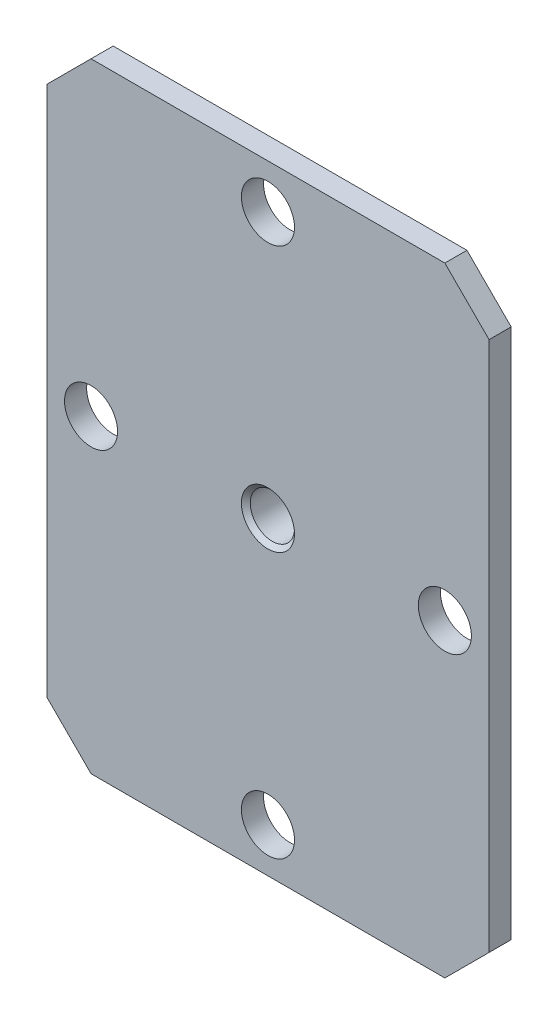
ISO-10303-21;
HEADER;
FILE_DESCRIPTION(('STEP AP214'),'2;1');
FILE_NAME('part.step','',(''),(''),'','','');
FILE_SCHEMA(('AUTOMOTIVE_DESIGN { 1 0 10303 214 1 1 1 1 }'));
ENDSEC;
DATA;
#1=APPLICATION_CONTEXT('core data for automotive mechanical design processes');
#2=APPLICATION_PROTOCOL_DEFINITION('international standard','automotive_design',2000,#1);
#3=PRODUCT_CONTEXT('',#1,'mechanical');
#4=PRODUCT('Part','Part','',(#3));
#5=PRODUCT_RELATED_PRODUCT_CATEGORY('part','',(#4));
#6=PRODUCT_DEFINITION_FORMATION('','',#4);
#7=PRODUCT_DEFINITION_CONTEXT('part definition',#1,'design');
#8=PRODUCT_DEFINITION('design','',#6,#7);
#9=PRODUCT_DEFINITION_SHAPE('','',#8);
#10=(LENGTH_UNIT() NAMED_UNIT(*) SI_UNIT(.MILLI.,.METRE.));
#11=(NAMED_UNIT(*) PLANE_ANGLE_UNIT() SI_UNIT($,.RADIAN.));
#12=(NAMED_UNIT(*) SI_UNIT($,.STERADIAN.) SOLID_ANGLE_UNIT());
#13=UNCERTAINTY_MEASURE_WITH_UNIT(LENGTH_MEASURE(1.E-05),#10,'distance_accuracy_value','');
#14=(GEOMETRIC_REPRESENTATION_CONTEXT(3) GLOBAL_UNCERTAINTY_ASSIGNED_CONTEXT((#13)) GLOBAL_UNIT_ASSIGNED_CONTEXT((#10,
#11,#12)) REPRESENTATION_CONTEXT('',''));
#15=CARTESIAN_POINT('',(0.,0.,0.));
#16=DIRECTION('',(0.,0.,1.));
#17=DIRECTION('',(1.,0.,0.));
#18=AXIS2_PLACEMENT_3D('',#15,#16,#17);
#19=CARTESIAN_POINT('',(-50.,70.,5.));
#20=DIRECTION('',(0.,-1.,0.));
#21=DIRECTION('',(1.,0.,0.));
#22=AXIS2_PLACEMENT_3D('',#19,#20,#21);
#23=PLANE('',#22);
#24=DIRECTION('',(-1.,0.,0.));
#25=VECTOR('',#24,1.);
#26=CARTESIAN_POINT('',(-50.,70.,0.));
#27=LINE('',#26,#25);
#28=CARTESIAN_POINT('',(40.,70.,0.));
#29=VERTEX_POINT('',#28);
#30=CARTESIAN_POINT('',(-40.,70.,0.));
#31=VERTEX_POINT('',#30);
#32=EDGE_CURVE('E190',#29,#31,#27,.T.);
#33=ORIENTED_EDGE('',*,*,#32,.T.);
#34=DIRECTION('',(0.,0.,1.));
#35=VECTOR('',#34,1.);
#36=CARTESIAN_POINT('',(-40.,70.,5.));
#37=LINE('',#36,#35);
#38=CARTESIAN_POINT('',(-40.,70.,5.));
#39=VERTEX_POINT('',#38);
#40=EDGE_CURVE('E228',#31,#39,#37,.T.);
#41=ORIENTED_EDGE('',*,*,#40,.T.);
#42=DIRECTION('',(-1.,0.,0.));
#43=VECTOR('',#42,1.);
#44=CARTESIAN_POINT('',(-50.,70.,5.));
#45=LINE('',#44,#43);
#46=CARTESIAN_POINT('',(40.,70.,5.));
#47=VERTEX_POINT('',#46);
#48=EDGE_CURVE('E191',#47,#39,#45,.T.);
#49=ORIENTED_EDGE('',*,*,#48,.F.);
#50=DIRECTION('',(0.,0.,-1.));
#51=VECTOR('',#50,1.);
#52=CARTESIAN_POINT('',(40.,70.,5.));
#53=LINE('',#52,#51);
#54=EDGE_CURVE('E225',#47,#29,#53,.T.);
#55=ORIENTED_EDGE('',*,*,#54,.T.);
#56=EDGE_LOOP('',(#33,#41,#49,#55));
#57=FACE_BOUND('',#56,.T.);
#58=ADVANCED_FACE('F33',(#57),#23,.F.);
#59=CARTESIAN_POINT('',(-50.,-70.,5.));
#60=DIRECTION('',(1.,0.,0.));
#61=DIRECTION('',(0.,1.,0.));
#62=AXIS2_PLACEMENT_3D('',#59,#60,#61);
#63=PLANE('',#62);
#64=DIRECTION('',(0.,-1.,0.));
#65=VECTOR('',#64,1.);
#66=CARTESIAN_POINT('',(-50.,-70.,5.));
#67=LINE('',#66,#65);
#68=CARTESIAN_POINT('',(-50.,60.,5.));
#69=VERTEX_POINT('',#68);
#70=CARTESIAN_POINT('',(-50.,-60.,5.));
#71=VERTEX_POINT('',#70);
#72=EDGE_CURVE('E194',#69,#71,#67,.T.);
#73=ORIENTED_EDGE('',*,*,#72,.F.);
#74=DIRECTION('',(0.,0.,-1.));
#75=VECTOR('',#74,1.);
#76=CARTESIAN_POINT('',(-50.,60.,5.));
#77=LINE('',#76,#75);
#78=CARTESIAN_POINT('',(-50.,60.,0.));
#79=VERTEX_POINT('',#78);
#80=EDGE_CURVE('E214',#69,#79,#77,.T.);
#81=ORIENTED_EDGE('',*,*,#80,.T.);
#82=DIRECTION('',(0.,-1.,0.));
#83=VECTOR('',#82,1.);
#84=CARTESIAN_POINT('',(-50.,-70.,0.));
#85=LINE('',#84,#83);
#86=CARTESIAN_POINT('',(-50.,-60.,0.));
#87=VERTEX_POINT('',#86);
#88=EDGE_CURVE('E206',#79,#87,#85,.T.);
#89=ORIENTED_EDGE('',*,*,#88,.T.);
#90=DIRECTION('',(0.,0.,1.));
#91=VECTOR('',#90,1.);
#92=CARTESIAN_POINT('',(-50.,-60.,5.));
#93=LINE('',#92,#91);
#94=EDGE_CURVE('E203',#87,#71,#93,.T.);
#95=ORIENTED_EDGE('',*,*,#94,.T.);
#96=EDGE_LOOP('',(#73,#81,#89,#95));
#97=FACE_BOUND('',#96,.T.);
#98=ADVANCED_FACE('F260',(#97),#63,.F.);
#99=CARTESIAN_POINT('',(-50.,-70.,5.));
#100=DIRECTION('',(0.,1.,0.));
#101=DIRECTION('',(-1.,0.,0.));
#102=AXIS2_PLACEMENT_3D('',#99,#100,#101);
#103=PLANE('',#102);
#104=DIRECTION('',(1.,0.,0.));
#105=VECTOR('',#104,1.);
#106=CARTESIAN_POINT('',(-50.,-70.,0.));
#107=LINE('',#106,#105);
#108=CARTESIAN_POINT('',(-40.,-70.,0.));
#109=VERTEX_POINT('',#108);
#110=CARTESIAN_POINT('',(40.,-70.,0.));
#111=VERTEX_POINT('',#110);
#112=EDGE_CURVE('E209',#109,#111,#107,.T.);
#113=ORIENTED_EDGE('',*,*,#112,.T.);
#114=DIRECTION('',(0.,0.,1.));
#115=VECTOR('',#114,1.);
#116=CARTESIAN_POINT('',(40.,-70.,5.));
#117=LINE('',#116,#115);
#118=CARTESIAN_POINT('',(40.,-70.,5.));
#119=VERTEX_POINT('',#118);
#120=EDGE_CURVE('E245',#111,#119,#117,.T.);
#121=ORIENTED_EDGE('',*,*,#120,.T.);
#122=DIRECTION('',(1.,0.,0.));
#123=VECTOR('',#122,1.);
#124=CARTESIAN_POINT('',(-50.,-70.,5.));
#125=LINE('',#124,#123);
#126=CARTESIAN_POINT('',(-40.,-70.,5.));
#127=VERTEX_POINT('',#126);
#128=EDGE_CURVE('E198',#127,#119,#125,.T.);
#129=ORIENTED_EDGE('',*,*,#128,.F.);
#130=DIRECTION('',(0.,0.,-1.));
#131=VECTOR('',#130,1.);
#132=CARTESIAN_POINT('',(-40.,-70.,5.));
#133=LINE('',#132,#131);
#134=EDGE_CURVE('E242',#127,#109,#133,.T.);
#135=ORIENTED_EDGE('',*,*,#134,.T.);
#136=EDGE_LOOP('',(#113,#121,#129,#135));
#137=FACE_BOUND('',#136,.T.);
#138=ADVANCED_FACE('F266',(#137),#103,.F.);
#139=CARTESIAN_POINT('',(50.,-70.,5.));
#140=DIRECTION('',(-1.,0.,0.));
#141=DIRECTION('',(0.,-1.,0.));
#142=AXIS2_PLACEMENT_3D('',#139,#140,#141);
#143=PLANE('',#142);
#144=DIRECTION('',(0.,1.,0.));
#145=VECTOR('',#144,1.);
#146=CARTESIAN_POINT('',(50.,-70.,0.));
#147=LINE('',#146,#145);
#148=CARTESIAN_POINT('',(50.,-60.,0.));
#149=VERTEX_POINT('',#148);
#150=CARTESIAN_POINT('',(50.,60.,0.));
#151=VERTEX_POINT('',#150);
#152=EDGE_CURVE('E195',#149,#151,#147,.T.);
#153=ORIENTED_EDGE('',*,*,#152,.T.);
#154=DIRECTION('',(0.,0.,1.));
#155=VECTOR('',#154,1.);
#156=CARTESIAN_POINT('',(50.,60.,5.));
#157=LINE('',#156,#155);
#158=CARTESIAN_POINT('',(50.,60.,5.));
#159=VERTEX_POINT('',#158);
#160=EDGE_CURVE('E56',#151,#159,#157,.T.);
#161=ORIENTED_EDGE('',*,*,#160,.T.);
#162=DIRECTION('',(0.,1.,0.));
#163=VECTOR('',#162,1.);
#164=CARTESIAN_POINT('',(50.,-70.,5.));
#165=LINE('',#164,#163);
#166=CARTESIAN_POINT('',(50.,-60.,5.));
#167=VERTEX_POINT('',#166);
#168=EDGE_CURVE('E201',#167,#159,#165,.T.);
#169=ORIENTED_EDGE('',*,*,#168,.F.);
#170=DIRECTION('',(0.,0.,-1.));
#171=VECTOR('',#170,1.);
#172=CARTESIAN_POINT('',(50.,-60.,5.));
#173=LINE('',#172,#171);
#174=EDGE_CURVE('E238',#167,#149,#173,.T.);
#175=ORIENTED_EDGE('',*,*,#174,.T.);
#176=EDGE_LOOP('',(#153,#161,#169,#175));
#177=FACE_BOUND('',#176,.T.);
#178=ADVANCED_FACE('F304',(#177),#143,.F.);
#179=CARTESIAN_POINT('',(50.,70.,5.));
#180=DIRECTION('',(0.,0.,1.));
#181=DIRECTION('',(1.,0.,0.));
#182=AXIS2_PLACEMENT_3D('',#179,#180,#181);
#183=PLANE('',#182);
#184=CARTESIAN_POINT('',(0.,0.,5.));
#185=DIRECTION('',(0.,0.,1.));
#186=DIRECTION('',(1.,0.,0.));
#187=AXIS2_PLACEMENT_3D('',#184,#185,#186);
#188=CIRCLE('',#187,6.00000000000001);
#189=CARTESIAN_POINT('',(6.00000000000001,0.,5.));
#190=VERTEX_POINT('',#189);
#191=EDGE_CURVE('E11',#190,#190,#188,.F.);
#192=ORIENTED_EDGE('',*,*,#191,.T.);
#193=EDGE_LOOP('',(#192));
#194=FACE_BOUND('',#193,.T.);
#195=CARTESIAN_POINT('',(-40.,0.,5.));
#196=DIRECTION('',(0.,0.,1.));
#197=DIRECTION('',(1.,0.,0.));
#198=AXIS2_PLACEMENT_3D('',#195,#196,#197);
#199=CIRCLE('',#198,5.99999999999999);
#200=CARTESIAN_POINT('',(-34.,0.,5.));
#201=VERTEX_POINT('',#200);
#202=EDGE_CURVE('E163',#201,#201,#199,.T.);
#203=ORIENTED_EDGE('',*,*,#202,.F.);
#204=EDGE_LOOP('',(#203));
#205=FACE_BOUND('',#204,.T.);
#206=CARTESIAN_POINT('',(0.,-60.,5.));
#207=DIRECTION('',(0.,0.,1.));
#208=DIRECTION('',(1.,0.,0.));
#209=AXIS2_PLACEMENT_3D('',#206,#207,#208);
#210=CIRCLE('',#209,6.);
#211=CARTESIAN_POINT('',(6.00000000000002,-60.,5.));
#212=VERTEX_POINT('',#211);
#213=EDGE_CURVE('E172',#212,#212,#210,.T.);
#214=ORIENTED_EDGE('',*,*,#213,.F.);
#215=EDGE_LOOP('',(#214));
#216=FACE_BOUND('',#215,.T.);
#217=CARTESIAN_POINT('',(40.,0.,5.));
#218=DIRECTION('',(0.,0.,1.));
#219=DIRECTION('',(1.,0.,0.));
#220=AXIS2_PLACEMENT_3D('',#217,#218,#219);
#221=CIRCLE('',#220,6.00000000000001);
#222=CARTESIAN_POINT('',(46.,0.,5.));
#223=VERTEX_POINT('',#222);
#224=EDGE_CURVE('E178',#223,#223,#221,.T.);
#225=ORIENTED_EDGE('',*,*,#224,.F.);
#226=EDGE_LOOP('',(#225));
#227=FACE_BOUND('',#226,.T.);
#228=CARTESIAN_POINT('',(0.,60.,5.));
#229=DIRECTION('',(0.,0.,1.));
#230=DIRECTION('',(1.,0.,0.));
#231=AXIS2_PLACEMENT_3D('',#228,#229,#230);
#232=CIRCLE('',#231,6.);
#233=CARTESIAN_POINT('',(6.,60.,5.));
#234=VERTEX_POINT('',#233);
#235=EDGE_CURVE('E184',#234,#234,#232,.T.);
#236=ORIENTED_EDGE('',*,*,#235,.F.);
#237=EDGE_LOOP('',(#236));
#238=FACE_BOUND('',#237,.T.);
#239=ORIENTED_EDGE('',*,*,#48,.T.);
#240=DIRECTION('',(0.707106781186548,0.707106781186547,0.));
#241=VECTOR('',#240,1.);
#242=CARTESIAN_POINT('',(5.00000000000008,115.,5.));
#243=LINE('',#242,#241);
#244=EDGE_CURVE('E236',#39,#69,#243,.F.);
#245=ORIENTED_EDGE('',*,*,#244,.T.);
#246=ORIENTED_EDGE('',*,*,#72,.T.);
#247=DIRECTION('',(-0.707106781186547,0.707106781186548,0.));
#248=VECTOR('',#247,1.);
#249=CARTESIAN_POINT('',(-65.0000000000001,-44.9999999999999,5.));
#250=LINE('',#249,#248);
#251=EDGE_CURVE('E230',#71,#127,#250,.F.);
#252=ORIENTED_EDGE('',*,*,#251,.T.);
#253=ORIENTED_EDGE('',*,*,#128,.T.);
#254=DIRECTION('',(-0.707106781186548,-0.707106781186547,0.));
#255=VECTOR('',#254,1.);
#256=CARTESIAN_POINT('',(115.,4.99999999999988,5.));
#257=LINE('',#256,#255);
#258=EDGE_CURVE('E232',#119,#167,#257,.F.);
#259=ORIENTED_EDGE('',*,*,#258,.T.);
#260=ORIENTED_EDGE('',*,*,#168,.T.);
#261=DIRECTION('',(0.707106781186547,-0.707106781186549,0.));
#262=VECTOR('',#261,1.);
#263=CARTESIAN_POINT('',(45.,65.,5.));
#264=LINE('',#263,#262);
#265=EDGE_CURVE('E234',#159,#47,#264,.F.);
#266=ORIENTED_EDGE('',*,*,#265,.T.);
#267=EDGE_LOOP('',(#239,#245,#246,#252,#253,#259,#260,#266));
#268=FACE_BOUND('',#267,.T.);
#269=ADVANCED_FACE('F296',(#194,#205,#216,#227,#238,#268),#183,.T.);
#270=CARTESIAN_POINT('',(50.,70.,0.));
#271=DIRECTION('',(0.,0.,1.));
#272=DIRECTION('',(1.,0.,0.));
#273=AXIS2_PLACEMENT_3D('',#270,#271,#272);
#274=PLANE('',#273);
#275=DIRECTION('',(0.,1.,0.));
#276=VECTOR('',#275,1.);
#277=CARTESIAN_POINT('',(10.,70.,0.));
#278=LINE('',#277,#276);
#279=CARTESIAN_POINT('',(10.,-9.99999999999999,0.));
#280=VERTEX_POINT('',#279);
#281=CARTESIAN_POINT('',(10.,10.,0.));
#282=VERTEX_POINT('',#281);
#283=EDGE_CURVE('E149',#280,#282,#278,.T.);
#284=ORIENTED_EDGE('',*,*,#283,.T.);
#285=DIRECTION('',(-1.,0.,0.));
#286=VECTOR('',#285,1.);
#287=CARTESIAN_POINT('',(50.,9.99999999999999,0.));
#288=LINE('',#287,#286);
#289=CARTESIAN_POINT('',(-10.,10.,0.));
#290=VERTEX_POINT('',#289);
#291=EDGE_CURVE('E158',#282,#290,#288,.T.);
#292=ORIENTED_EDGE('',*,*,#291,.T.);
#293=DIRECTION('',(0.,-1.,0.));
#294=VECTOR('',#293,1.);
#295=CARTESIAN_POINT('',(-10.,70.,0.));
#296=LINE('',#295,#294);
#297=CARTESIAN_POINT('',(-10.,-9.99999999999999,0.));
#298=VERTEX_POINT('',#297);
#299=EDGE_CURVE('E129',#290,#298,#296,.T.);
#300=ORIENTED_EDGE('',*,*,#299,.T.);
#301=DIRECTION('',(1.,0.,0.));
#302=VECTOR('',#301,1.);
#303=CARTESIAN_POINT('',(50.,-9.99999999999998,0.));
#304=LINE('',#303,#302);
#305=EDGE_CURVE('E48',#298,#280,#304,.T.);
#306=ORIENTED_EDGE('',*,*,#305,.T.);
#307=EDGE_LOOP('',(#284,#292,#300,#306));
#308=FACE_BOUND('',#307,.T.);
#309=CARTESIAN_POINT('',(-40.,0.,0.));
#310=DIRECTION('',(0.,0.,1.));
#311=DIRECTION('',(1.,0.,0.));
#312=AXIS2_PLACEMENT_3D('',#309,#310,#311);
#313=CIRCLE('',#312,5.99999999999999);
#314=CARTESIAN_POINT('',(-34.,0.,0.));
#315=VERTEX_POINT('',#314);
#316=EDGE_CURVE('E169',#315,#315,#313,.F.);
#317=ORIENTED_EDGE('',*,*,#316,.F.);
#318=EDGE_LOOP('',(#317));
#319=FACE_BOUND('',#318,.T.);
#320=CARTESIAN_POINT('',(0.,-60.,0.));
#321=DIRECTION('',(0.,0.,1.));
#322=DIRECTION('',(1.,0.,0.));
#323=AXIS2_PLACEMENT_3D('',#320,#321,#322);
#324=CIRCLE('',#323,6.);
#325=CARTESIAN_POINT('',(6.00000000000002,-60.,0.));
#326=VERTEX_POINT('',#325);
#327=EDGE_CURVE('E175',#326,#326,#324,.F.);
#328=ORIENTED_EDGE('',*,*,#327,.F.);
#329=EDGE_LOOP('',(#328));
#330=FACE_BOUND('',#329,.T.);
#331=CARTESIAN_POINT('',(40.,0.,0.));
#332=DIRECTION('',(0.,0.,1.));
#333=DIRECTION('',(1.,0.,0.));
#334=AXIS2_PLACEMENT_3D('',#331,#332,#333);
#335=CIRCLE('',#334,6.00000000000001);
#336=CARTESIAN_POINT('',(46.,0.,0.));
#337=VERTEX_POINT('',#336);
#338=EDGE_CURVE('E181',#337,#337,#335,.F.);
#339=ORIENTED_EDGE('',*,*,#338,.F.);
#340=EDGE_LOOP('',(#339));
#341=FACE_BOUND('',#340,.T.);
#342=CARTESIAN_POINT('',(0.,60.,0.));
#343=DIRECTION('',(0.,0.,1.));
#344=DIRECTION('',(1.,0.,0.));
#345=AXIS2_PLACEMENT_3D('',#342,#343,#344);
#346=CIRCLE('',#345,6.);
#347=CARTESIAN_POINT('',(6.,60.,0.));
#348=VERTEX_POINT('',#347);
#349=EDGE_CURVE('E187',#348,#348,#346,.F.);
#350=ORIENTED_EDGE('',*,*,#349,.F.);
#351=EDGE_LOOP('',(#350));
#352=FACE_BOUND('',#351,.T.);
#353=ORIENTED_EDGE('',*,*,#88,.F.);
#354=DIRECTION('',(-0.707106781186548,-0.707106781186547,0.));
#355=VECTOR('',#354,1.);
#356=CARTESIAN_POINT('',(-50.,60.,0.));
#357=LINE('',#356,#355);
#358=EDGE_CURVE('E223',#79,#31,#357,.F.);
#359=ORIENTED_EDGE('',*,*,#358,.T.);
#360=ORIENTED_EDGE('',*,*,#32,.F.);
#361=DIRECTION('',(-0.707106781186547,0.707106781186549,0.));
#362=VECTOR('',#361,1.);
#363=CARTESIAN_POINT('',(40.,70.,0.));
#364=LINE('',#363,#362);
#365=EDGE_CURVE('E221',#29,#151,#364,.F.);
#366=ORIENTED_EDGE('',*,*,#365,.T.);
#367=ORIENTED_EDGE('',*,*,#152,.F.);
#368=DIRECTION('',(0.707106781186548,0.707106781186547,0.));
#369=VECTOR('',#368,1.);
#370=CARTESIAN_POINT('',(50.,-60.,0.));
#371=LINE('',#370,#369);
#372=EDGE_CURVE('E219',#149,#111,#371,.F.);
#373=ORIENTED_EDGE('',*,*,#372,.T.);
#374=ORIENTED_EDGE('',*,*,#112,.F.);
#375=DIRECTION('',(0.707106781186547,-0.707106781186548,0.));
#376=VECTOR('',#375,1.);
#377=CARTESIAN_POINT('',(-40.,-70.,0.));
#378=LINE('',#377,#376);
#379=EDGE_CURVE('E217',#109,#87,#378,.F.);
#380=ORIENTED_EDGE('',*,*,#379,.T.);
#381=EDGE_LOOP('',(#353,#359,#360,#366,#367,#373,#374,#380));
#382=FACE_BOUND('',#381,.T.);
#383=ADVANCED_FACE('F308',(#308,#319,#330,#341,#352,#382),#274,.F.);
#384=CARTESIAN_POINT('',(0.,60.,-0.00100000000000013));
#385=DIRECTION('',(0.,0.,1.));
#386=DIRECTION('',(1.,0.,0.));
#387=AXIS2_PLACEMENT_3D('',#384,#385,#386);
#388=CYLINDRICAL_SURFACE('',#387,6.);
#389=ORIENTED_EDGE('',*,*,#235,.T.);
#390=EDGE_LOOP('',(#389));
#391=FACE_BOUND('',#390,.T.);
#392=ORIENTED_EDGE('',*,*,#349,.T.);
#393=EDGE_LOOP('',(#392));
#394=FACE_BOUND('',#393,.T.);
#395=ADVANCED_FACE('F316',(#391,#394),#388,.F.);
#396=CARTESIAN_POINT('',(40.,0.,-0.00100000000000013));
#397=DIRECTION('',(0.,0.,1.));
#398=DIRECTION('',(1.,0.,0.));
#399=AXIS2_PLACEMENT_3D('',#396,#397,#398);
#400=CYLINDRICAL_SURFACE('',#399,6.00000000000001);
#401=ORIENTED_EDGE('',*,*,#224,.T.);
#402=EDGE_LOOP('',(#401));
#403=FACE_BOUND('',#402,.T.);
#404=ORIENTED_EDGE('',*,*,#338,.T.);
#405=EDGE_LOOP('',(#404));
#406=FACE_BOUND('',#405,.T.);
#407=ADVANCED_FACE('F323',(#403,#406),#400,.F.);
#408=CARTESIAN_POINT('',(0.,-60.,-0.00100000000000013));
#409=DIRECTION('',(0.,0.,1.));
#410=DIRECTION('',(1.,0.,0.));
#411=AXIS2_PLACEMENT_3D('',#408,#409,#410);
#412=CYLINDRICAL_SURFACE('',#411,6.);
#413=ORIENTED_EDGE('',*,*,#213,.T.);
#414=EDGE_LOOP('',(#413));
#415=FACE_BOUND('',#414,.T.);
#416=ORIENTED_EDGE('',*,*,#327,.T.);
#417=EDGE_LOOP('',(#416));
#418=FACE_BOUND('',#417,.T.);
#419=ADVANCED_FACE('F423',(#415,#418),#412,.F.);
#420=CARTESIAN_POINT('',(-40.,0.,-0.00100000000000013));
#421=DIRECTION('',(0.,0.,1.));
#422=DIRECTION('',(1.,0.,0.));
#423=AXIS2_PLACEMENT_3D('',#420,#421,#422);
#424=CYLINDRICAL_SURFACE('',#423,5.99999999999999);
#425=ORIENTED_EDGE('',*,*,#202,.T.);
#426=EDGE_LOOP('',(#425));
#427=FACE_BOUND('',#426,.T.);
#428=ORIENTED_EDGE('',*,*,#316,.T.);
#429=EDGE_LOOP('',(#428));
#430=FACE_BOUND('',#429,.T.);
#431=ADVANCED_FACE('F275',(#427,#430),#424,.F.);
#432=CARTESIAN_POINT('',(-50.,60.,5.));
#433=DIRECTION('',(0.707106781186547,-0.707106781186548,0.));
#434=DIRECTION('',(0.707106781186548,0.707106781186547,0.));
#435=AXIS2_PLACEMENT_3D('',#432,#433,#434);
#436=PLANE('',#435);
#437=ORIENTED_EDGE('',*,*,#244,.F.);
#438=ORIENTED_EDGE('',*,*,#40,.F.);
#439=ORIENTED_EDGE('',*,*,#358,.F.);
#440=ORIENTED_EDGE('',*,*,#80,.F.);
#441=EDGE_LOOP('',(#437,#438,#439,#440));
#442=FACE_BOUND('',#441,.T.);
#443=ADVANCED_FACE('F271',(#442),#436,.F.);
#444=CARTESIAN_POINT('',(40.,70.,5.));
#445=DIRECTION('',(-0.707106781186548,-0.707106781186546,0.));
#446=DIRECTION('',(0.707106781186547,-0.707106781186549,0.));
#447=AXIS2_PLACEMENT_3D('',#444,#445,#446);
#448=PLANE('',#447);
#449=ORIENTED_EDGE('',*,*,#265,.F.);
#450=ORIENTED_EDGE('',*,*,#160,.F.);
#451=ORIENTED_EDGE('',*,*,#365,.F.);
#452=ORIENTED_EDGE('',*,*,#54,.F.);
#453=EDGE_LOOP('',(#449,#450,#451,#452));
#454=FACE_BOUND('',#453,.T.);
#455=ADVANCED_FACE('F274',(#454),#448,.F.);
#456=CARTESIAN_POINT('',(50.,-60.,5.));
#457=DIRECTION('',(-0.707106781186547,0.707106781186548,0.));
#458=DIRECTION('',(-0.707106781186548,-0.707106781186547,0.));
#459=AXIS2_PLACEMENT_3D('',#456,#457,#458);
#460=PLANE('',#459);
#461=ORIENTED_EDGE('',*,*,#258,.F.);
#462=ORIENTED_EDGE('',*,*,#120,.F.);
#463=ORIENTED_EDGE('',*,*,#372,.F.);
#464=ORIENTED_EDGE('',*,*,#174,.F.);
#465=EDGE_LOOP('',(#461,#462,#463,#464));
#466=FACE_BOUND('',#465,.T.);
#467=ADVANCED_FACE('F279',(#466),#460,.F.);
#468=CARTESIAN_POINT('',(-40.,-70.,5.));
#469=DIRECTION('',(0.707106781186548,0.707106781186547,0.));
#470=DIRECTION('',(-0.707106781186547,0.707106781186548,0.));
#471=AXIS2_PLACEMENT_3D('',#468,#469,#470);
#472=PLANE('',#471);
#473=ORIENTED_EDGE('',*,*,#251,.F.);
#474=ORIENTED_EDGE('',*,*,#94,.F.);
#475=ORIENTED_EDGE('',*,*,#379,.F.);
#476=ORIENTED_EDGE('',*,*,#134,.F.);
#477=EDGE_LOOP('',(#473,#474,#475,#476));
#478=FACE_BOUND('',#477,.T.);
#479=ADVANCED_FACE('F282',(#478),#472,.F.);
#480=CARTESIAN_POINT('',(50.,9.99999999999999,-7.));
#481=DIRECTION('',(0.,1.,0.));
#482=DIRECTION('',(-1.,0.,0.));
#483=AXIS2_PLACEMENT_3D('',#480,#481,#482);
#484=PLANE('',#483);
#485=ORIENTED_EDGE('',*,*,#291,.F.);
#486=DIRECTION('',(0.,0.,1.));
#487=VECTOR('',#486,1.);
#488=CARTESIAN_POINT('',(10.,10.,-7.));
#489=LINE('',#488,#487);
#490=CARTESIAN_POINT('',(10.,10.,-7.));
#491=VERTEX_POINT('',#490);
#492=EDGE_CURVE('E148',#491,#282,#489,.T.);
#493=ORIENTED_EDGE('',*,*,#492,.F.);
#494=DIRECTION('',(-1.,0.,0.));
#495=VECTOR('',#494,1.);
#496=CARTESIAN_POINT('',(50.,9.99999999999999,-7.));
#497=LINE('',#496,#495);
#498=CARTESIAN_POINT('',(-10.,10.,-7.));
#499=VERTEX_POINT('',#498);
#500=EDGE_CURVE('E142',#491,#499,#497,.T.);
#501=ORIENTED_EDGE('',*,*,#500,.T.);
#502=DIRECTION('',(0.,0.,1.));
#503=VECTOR('',#502,1.);
#504=CARTESIAN_POINT('',(-10.,10.,-7.));
#505=LINE('',#504,#503);
#506=EDGE_CURVE('E124',#499,#290,#505,.T.);
#507=ORIENTED_EDGE('',*,*,#506,.T.);
#508=EDGE_LOOP('',(#485,#493,#501,#507));
#509=FACE_BOUND('',#508,.T.);
#510=ADVANCED_FACE('F147',(#509),#484,.T.);
#511=CARTESIAN_POINT('',(10.,70.,-7.));
#512=DIRECTION('',(1.,0.,0.));
#513=DIRECTION('',(0.,1.,0.));
#514=AXIS2_PLACEMENT_3D('',#511,#512,#513);
#515=PLANE('',#514);
#516=ORIENTED_EDGE('',*,*,#283,.F.);
#517=DIRECTION('',(0.,0.,1.));
#518=VECTOR('',#517,1.);
#519=CARTESIAN_POINT('',(10.,-9.99999999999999,-7.));
#520=LINE('',#519,#518);
#521=CARTESIAN_POINT('',(10.,-9.99999999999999,-7.));
#522=VERTEX_POINT('',#521);
#523=EDGE_CURVE('E164',#522,#280,#520,.T.);
#524=ORIENTED_EDGE('',*,*,#523,.F.);
#525=DIRECTION('',(0.,1.,0.));
#526=VECTOR('',#525,1.);
#527=CARTESIAN_POINT('',(10.,70.,-7.));
#528=LINE('',#527,#526);
#529=EDGE_CURVE('E135',#522,#491,#528,.T.);
#530=ORIENTED_EDGE('',*,*,#529,.T.);
#531=ORIENTED_EDGE('',*,*,#492,.T.);
#532=EDGE_LOOP('',(#516,#524,#530,#531));
#533=FACE_BOUND('',#532,.T.);
#534=ADVANCED_FACE('F289',(#533),#515,.T.);
#535=CARTESIAN_POINT('',(50.,-9.99999999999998,-7.));
#536=DIRECTION('',(0.,-1.,0.));
#537=DIRECTION('',(1.,0.,0.));
#538=AXIS2_PLACEMENT_3D('',#535,#536,#537);
#539=PLANE('',#538);
#540=ORIENTED_EDGE('',*,*,#305,.F.);
#541=DIRECTION('',(0.,0.,1.));
#542=VECTOR('',#541,1.);
#543=CARTESIAN_POINT('',(-10.,-10.,-7.));
#544=LINE('',#543,#542);
#545=CARTESIAN_POINT('',(-10.,-10.,-7.));
#546=VERTEX_POINT('',#545);
#547=EDGE_CURVE('E134',#546,#298,#544,.T.);
#548=ORIENTED_EDGE('',*,*,#547,.F.);
#549=DIRECTION('',(1.,0.,0.));
#550=VECTOR('',#549,1.);
#551=CARTESIAN_POINT('',(50.,-9.99999999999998,-7.));
#552=LINE('',#551,#550);
#553=EDGE_CURVE('E145',#546,#522,#552,.T.);
#554=ORIENTED_EDGE('',*,*,#553,.T.);
#555=ORIENTED_EDGE('',*,*,#523,.T.);
#556=EDGE_LOOP('',(#540,#548,#554,#555));
#557=FACE_BOUND('',#556,.T.);
#558=ADVANCED_FACE('F371',(#557),#539,.T.);
#559=CARTESIAN_POINT('',(-10.,70.,-7.));
#560=DIRECTION('',(-1.,0.,0.));
#561=DIRECTION('',(0.,-1.,0.));
#562=AXIS2_PLACEMENT_3D('',#559,#560,#561);
#563=PLANE('',#562);
#564=ORIENTED_EDGE('',*,*,#299,.F.);
#565=ORIENTED_EDGE('',*,*,#506,.F.);
#566=DIRECTION('',(0.,-1.,0.));
#567=VECTOR('',#566,1.);
#568=CARTESIAN_POINT('',(-10.,70.,-7.));
#569=LINE('',#568,#567);
#570=EDGE_CURVE('E127',#499,#546,#569,.T.);
#571=ORIENTED_EDGE('',*,*,#570,.T.);
#572=ORIENTED_EDGE('',*,*,#547,.T.);
#573=EDGE_LOOP('',(#564,#565,#571,#572));
#574=FACE_BOUND('',#573,.T.);
#575=ADVANCED_FACE('F126',(#574),#563,.T.);
#576=CARTESIAN_POINT('',(10.,10.,-7.));
#577=DIRECTION('',(0.,0.,-1.));
#578=DIRECTION('',(-1.,0.,0.));
#579=AXIS2_PLACEMENT_3D('',#576,#577,#578);
#580=PLANE('',#579);
#581=CARTESIAN_POINT('',(0.,0.,-7.));
#582=DIRECTION('',(0.,0.,-1.));
#583=DIRECTION('',(-1.,0.,0.));
#584=AXIS2_PLACEMENT_3D('',#581,#582,#583);
#585=CIRCLE('',#584,5.);
#586=CARTESIAN_POINT('',(-5.,0.,-7.));
#587=VERTEX_POINT('',#586);
#588=EDGE_CURVE('E154',#587,#587,#585,.F.);
#589=ORIENTED_EDGE('',*,*,#588,.T.);
#590=EDGE_LOOP('',(#589));
#591=FACE_BOUND('',#590,.T.);
#592=ORIENTED_EDGE('',*,*,#500,.F.);
#593=ORIENTED_EDGE('',*,*,#529,.F.);
#594=ORIENTED_EDGE('',*,*,#553,.F.);
#595=ORIENTED_EDGE('',*,*,#570,.F.);
#596=EDGE_LOOP('',(#592,#593,#594,#595));
#597=FACE_BOUND('',#596,.T.);
#598=ADVANCED_FACE('F140',(#591,#597),#580,.T.);
#599=CARTESIAN_POINT('',(0.,0.,-7.001));
#600=DIRECTION('',(0.,0.,1.));
#601=DIRECTION('',(1.,0.,0.));
#602=AXIS2_PLACEMENT_3D('',#599,#600,#601);
#603=CYLINDRICAL_SURFACE('',#602,5.);
#604=CARTESIAN_POINT('',(0.,0.,4.00000000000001));
#605=DIRECTION('',(0.,0.,1.));
#606=DIRECTION('',(1.,0.,0.));
#607=AXIS2_PLACEMENT_3D('',#604,#605,#606);
#608=CIRCLE('',#607,5.);
#609=CARTESIAN_POINT('',(5.,0.,4.00000000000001));
#610=VERTEX_POINT('',#609);
#611=EDGE_CURVE('E41',#610,#610,#608,.T.);
#612=ORIENTED_EDGE('',*,*,#611,.T.);
#613=EDGE_LOOP('',(#612));
#614=FACE_BOUND('',#613,.T.);
#615=ORIENTED_EDGE('',*,*,#588,.F.);
#616=EDGE_LOOP('',(#615));
#617=FACE_BOUND('',#616,.T.);
#618=ADVANCED_FACE('F249',(#614,#617),#603,.F.);
#619=CARTESIAN_POINT('',(0.,0.,4.00000000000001));
#620=DIRECTION('',(0.,0.,1.));
#621=DIRECTION('',(1.,0.,0.));
#622=AXIS2_PLACEMENT_3D('',#619,#620,#621);
#623=CONICAL_SURFACE('',#622,5.,0.785398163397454);
#624=ORIENTED_EDGE('',*,*,#191,.F.);
#625=EDGE_LOOP('',(#624));
#626=FACE_BOUND('',#625,.T.);
#627=ORIENTED_EDGE('',*,*,#611,.F.);
#628=EDGE_LOOP('',(#627));
#629=FACE_BOUND('',#628,.T.);
#630=ADVANCED_FACE('F35',(#626,#629),#623,.F.);
#631=CLOSED_SHELL('',(#58,#98,#138,#178,#269,#383,#395,#407,#419,#431,#443,#455,#467,#479,#510,
#534,#558,#575,#598,#618,#630));
#632=MANIFOLD_SOLID_BREP('B2',#631);
#633=ADVANCED_BREP_SHAPE_REPRESENTATION('',(#18,#632),#14);
#634=SHAPE_DEFINITION_REPRESENTATION(#9,#633);
ENDSEC;
END-ISO-10303-21;
